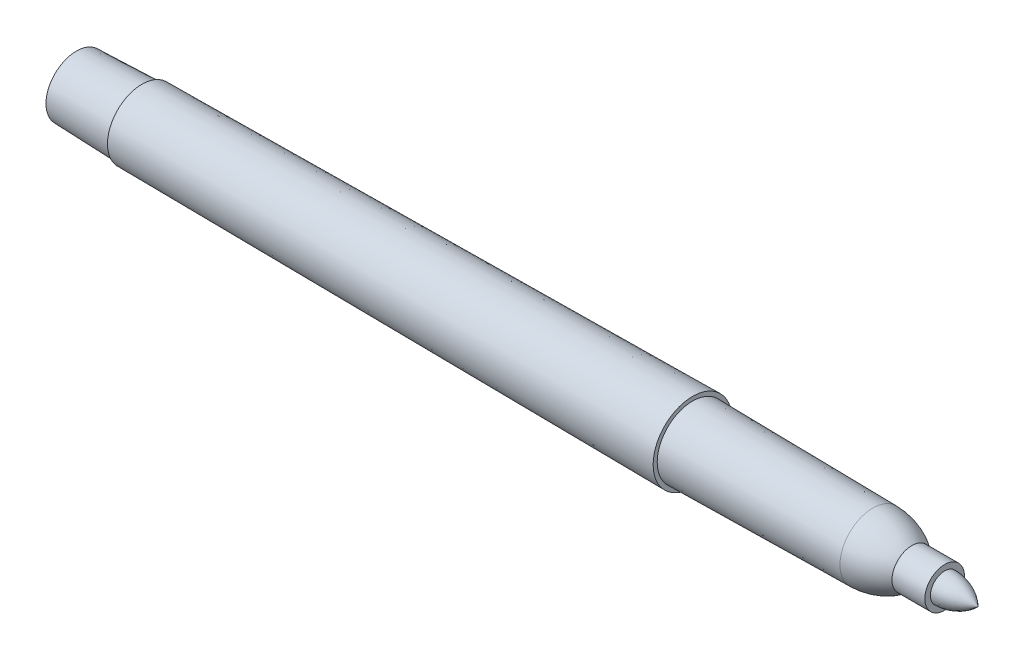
from build123d import *


with BuildPart() as part:
    # Sketch1 → Revolve1 (revolve)
    with BuildSketch(Plane(origin=(0, 0, 0), x_dir=(1, 0, 0), z_dir=(0, 1, 0)), mode=Mode.PRIVATE) as revolve1_sk:
        with BuildLine():
            Line((0, 0), (127, 0))
            ThreePointArc((127, 0), (124.852379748, 1.476056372), (122.301, 2.0066))
            Line((122.301, 2.0066), (122.301, 2.794))
            Line((122.301, 2.794), (117.6782, 2.794))
            ThreePointArc((117.6782, 2.794), (115.079027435, 4.143852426), (112.1918, 4.6355))
            Line((112.1918, 4.6355), (86.7918, 4.9784))
            Line((86.7918, 4.9784), (86.7918, 5.5499))
            Line((86.7918, 5.5499), (9.2456, 4.8641))
            Line((9.2456, 4.8641), (9.2456, 4.5847))
            Line((9.2456, 4.5847), (0, 4.2799))
            Line((0, 4.2799), (0, 0))
        make_face()
    revolve(revolve1_sk.sketch.rotate(Axis((0, 0, 0), (1, 0, 0)), 180), axis=Axis((0, 0, 0), (1, 0, 0)))


solid = part.part
